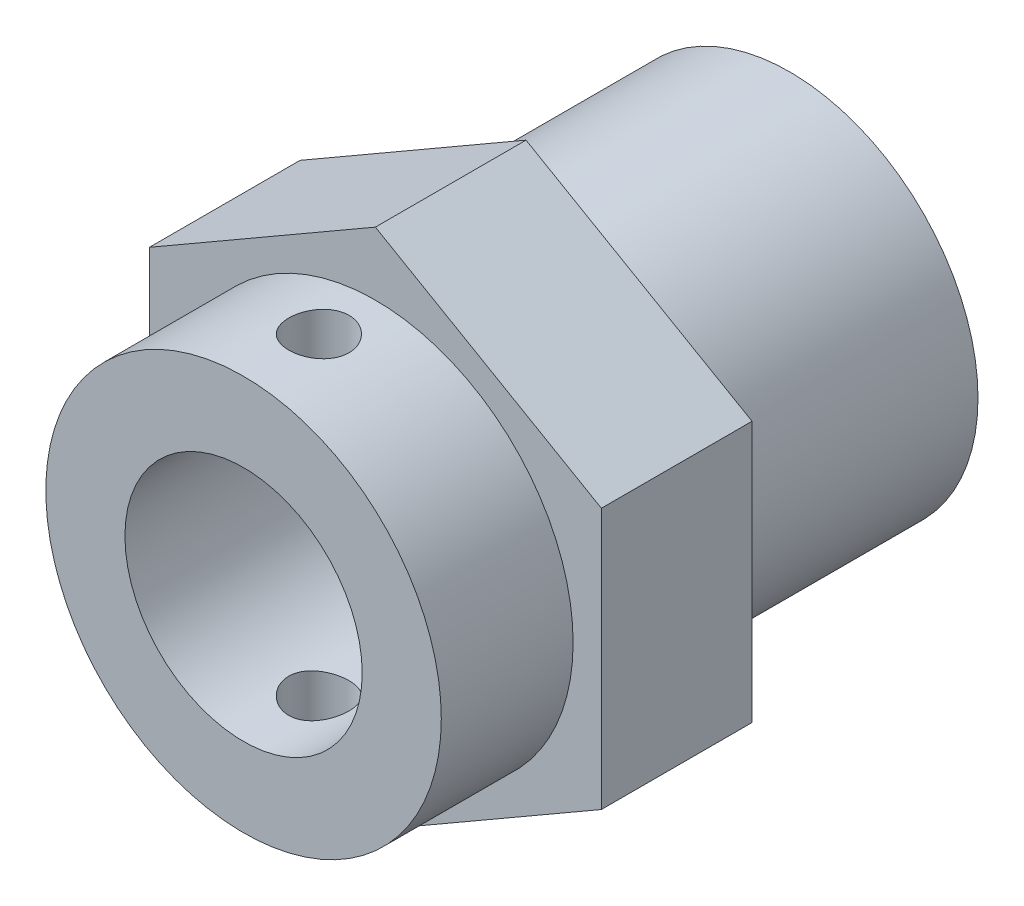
from build123d import *

# Parameters (mm, degrees)
SKIZZE1_R                       = 5
AUFSATZ_LINEAR_AUSTRAGEN1_DEPTH = 7
AUFSATZ_LINEAR_AUSTRAGEN2_DEPTH = 4
SKIZZE3_R                       = 5.25
AUFSATZ_LINEAR_AUSTRAGEN3_DEPTH = 3.5
SKIZZE4_R                       = 3.15
SCHNITT_LINEAR_AUSTRAGEN1_DEPTH = 18.153716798
SKIZZE6_R                       = 3.15
AUFSATZ_LINEAR_AUSTRAGEN5_DEPTH = 10
SKIZZE8_R                       = 0.8
SCHNITT_LINEAR_AUSTRAGEN2_DEPTH = 16.509952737


with BuildPart() as part:
    # Skizze1 → Aufsatz-Linear austragen1 (new body)
    with BuildSketch(Plane.XY):
        Circle(SKIZZE1_R)
    extrude(amount=-AUFSATZ_LINEAR_AUSTRAGEN1_DEPTH)

    # Skizze2 → Aufsatz-Linear austragen2 (add)
    with BuildSketch(Plane.XY):
        Polygon((6, 3.464101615), (0, 6.92820323), (-6, 3.464101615), (-6, -3.464101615), (0, -6.92820323), (6, -3.464101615), align=None)
    extrude(amount=AUFSATZ_LINEAR_AUSTRAGEN2_DEPTH)

    # Skizze3 → Aufsatz-Linear austragen3 (add)
    with BuildSketch(Plane.XY.offset(4)):
        Circle(SKIZZE3_R)
    extrude(amount=AUFSATZ_LINEAR_AUSTRAGEN3_DEPTH)

    # Skizze4 → Schnitt-Linear austragen1 (cut, through all)
    with BuildSketch(Plane.XY.offset(7.5)):
        Circle(SKIZZE4_R)
    extrude(amount=-SCHNITT_LINEAR_AUSTRAGEN1_DEPTH, mode=Mode.SUBTRACT)

    # Skizze8 → Schnitt-Linear austragen2 (cut, through all)
    with BuildSketch(Plane(origin=(0, 5.25, 0), x_dir=(1, 0, 0), z_dir=(0, 1, 0))):
        with Locations(Location((0, -5.5, 0), (0, 0, 270))):
            Circle(SKIZZE8_R)
    extrude(amount=-SCHNITT_LINEAR_AUSTRAGEN2_DEPTH, mode=Mode.SUBTRACT)


with BuildPart() as body_2:
    # Skizze6 → Aufsatz-Linear austragen5 (new body)
    with BuildSketch(Plane(origin=(0, 0, -7), x_dir=(-1, 0, 0), z_dir=(0, 0, -1))):
        Circle(SKIZZE6_R)
    extrude(amount=-AUFSATZ_LINEAR_AUSTRAGEN5_DEPTH)


solid = Compound([part.part, body_2.part])
